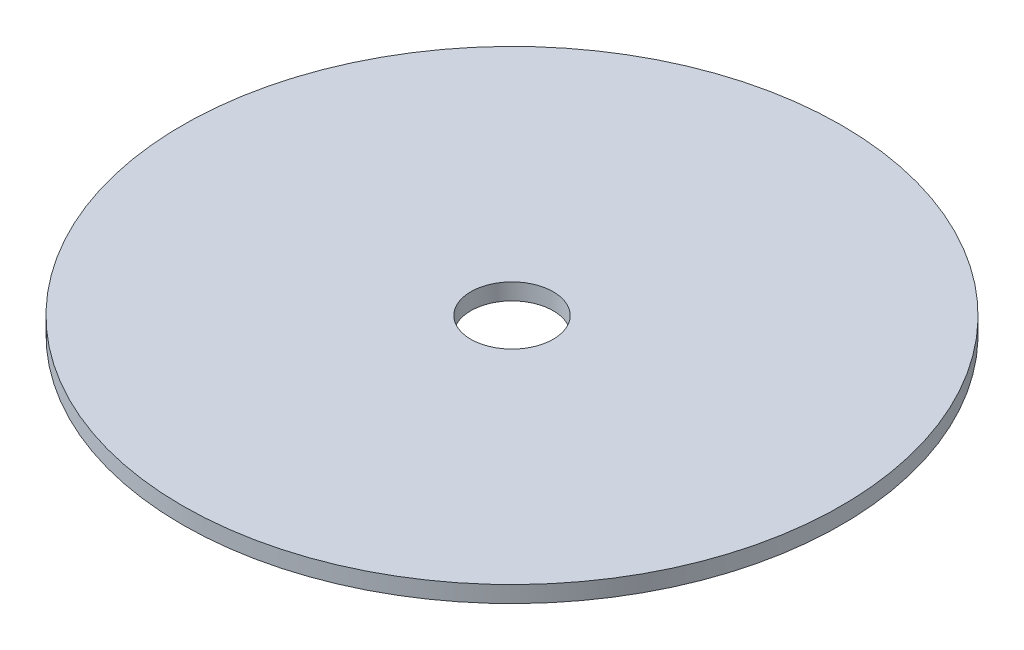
from build123d import *

# Parameters (mm, degrees)
SKIZZE1_R                       = 40
SKIZZE1_R_2                     = 5
AUFSATZ_LINEAR_AUSTRAGEN1_DEPTH = 2


with BuildPart() as part:
    # Skizze1 → Aufsatz-Linear austragen1 (new body)
    with BuildSketch(Plane(origin=(0, 0, 0), x_dir=(1, 0, 0), z_dir=(0, 1, 0))):
        with Locations(Location((0, 0, 0), (0, 0, 270))):
            Circle(SKIZZE1_R)
        with Locations(Location((0, 0, 0), (0, 0, 270))):
            Circle(SKIZZE1_R_2, mode=Mode.SUBTRACT)
    extrude(amount=AUFSATZ_LINEAR_AUSTRAGEN1_DEPTH)


solid = part.part
